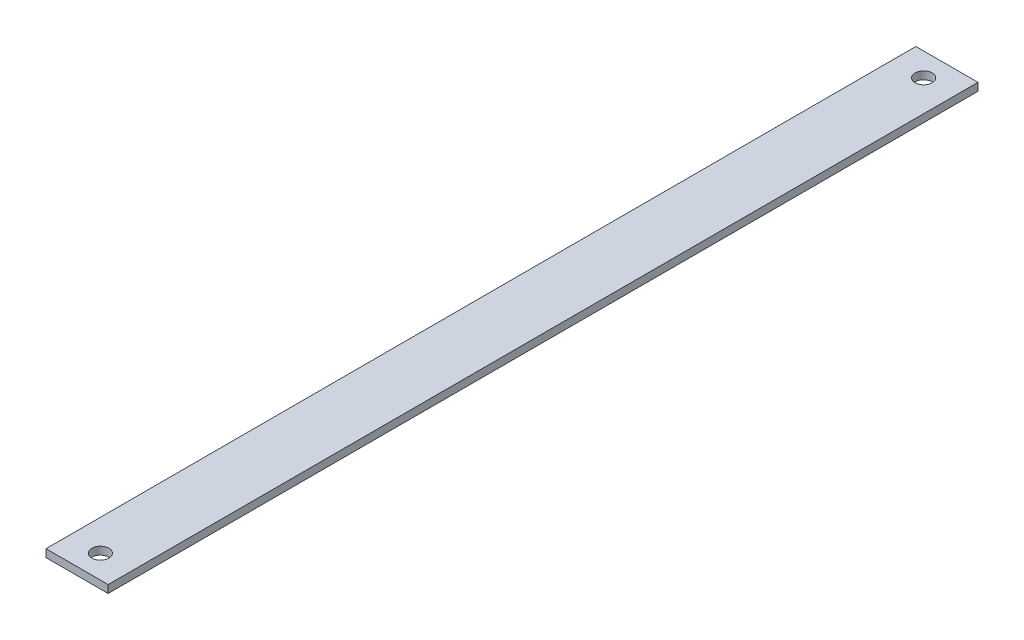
from build123d import *

# Parameters (mm, degrees)
ESQUISSE1_W             = 40
ESQUISSE1_H             = 5
BASE_EXTRUSION_DEPTH    = 560
ESQUISSE2_R             = 5.5
ENL_V_MAT_EXTRU_1_DEPTH = 562.449018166


with BuildPart() as part:
    # Esquisse1 → Base-Extrusion (new body)
    with BuildSketch(Plane.XY):
        with Locations((20, 2.5)):
            Rectangle(ESQUISSE1_W, ESQUISSE1_H)
    extrude(amount=BASE_EXTRUSION_DEPTH)

    # Esquisse2 → Enl_v. mat.-Extru.1 (cut, through all)
    with BuildSketch(Plane(origin=(0, 5, 0), x_dir=(-1, 0, 0), z_dir=(0, 1, 0))):
        with Locations(Location((-20, 15, 0), (0, 0, 90))):
            Circle(ESQUISSE2_R)
        with Locations(Location((-20, 545, 0), (0, 0, 90))):
            Circle(ESQUISSE2_R)
    extrude(amount=-ENL_V_MAT_EXTRU_1_DEPTH, mode=Mode.SUBTRACT)


solid = part.part
